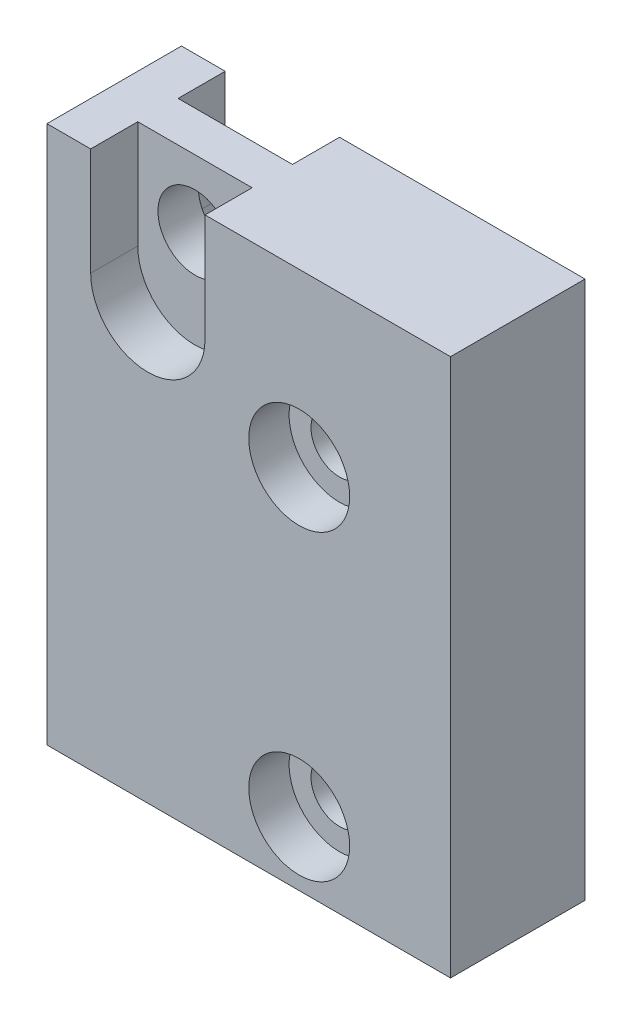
from build123d import *

# Parameters (mm, degrees)
EXTRUSION1_DEPTH      = 10
EXTRUSION1_DEPTH_BACK = 10
SKETCH1_W             = 60
SKETCH1_H             = 80
SKETCH1_R             = 5.5
SKETCH1_R_2           = 4.25
EXTRUSION2_START      = -6
SKETCH2_R             = 7.5
SKETCH2_R_2           = 4.25
EXTRUSION2_DEPTH      = 6
EXTRUSION3_START      = -7
SKETCH3_R             = 5.5
EXTRUSION3_DEPTH      = 7


with BuildPart() as part:
    # Sketch1 → Extrusion1 (new, two sides: drawn at the far end of the back side and taken through both)
    with BuildSketch(Plane.XY.offset(-EXTRUSION1_DEPTH_BACK)):
        Rectangle(SKETCH1_W, SKETCH1_H)
        with Locations((-15, 30)):
            Circle(SKETCH1_R, mode=Mode.SUBTRACT)
        with Locations((7.5, 14.5)):
            Circle(SKETCH1_R_2, mode=Mode.SUBTRACT)
        with Locations((7.5, -30.5)):
            Circle(SKETCH1_R_2, mode=Mode.SUBTRACT)
    extrude(amount=EXTRUSION1_DEPTH + EXTRUSION1_DEPTH_BACK)

    # Sketch2 → Extrusion2 (cut)
    # profile 1 of 2: a face of its own
    with BuildSketch(Plane.XY.offset(10).offset(EXTRUSION2_START)):
        with Locations((7.5, -30.5)):
            Circle(SKETCH2_R)
        with Locations((7.5, -30.5)):
            Circle(SKETCH2_R_2, mode=Mode.SUBTRACT)
    # profile 2 of 2: a face of its own
    with BuildSketch(Plane.XY.offset(10).offset(EXTRUSION2_START)):
        with Locations((7.5, 14.5)):
            Circle(SKETCH2_R)
        with Locations((7.5, 14.5)):
            Circle(SKETCH2_R_2, mode=Mode.SUBTRACT)
    extrusion2 = extrude(amount=EXTRUSION2_DEPTH, mode=Mode.SUBTRACT)

    # Sketch3 → Extrusion3 (cut)
    with BuildSketch(Plane.XY.offset(10).offset(EXTRUSION3_START)):
        with BuildLine():
            ThreePointArc((-23.5, 24), (-15, 15.5), (-6.5, 24))
            Line((-6.5, 24), (-6.5, 40))
            Line((-6.5, 40), (-23.5, 40))
            Line((-23.5, 40), (-23.5, 24))
        make_face()
        with Locations((-15, 30)):
            Circle(SKETCH3_R, mode=Mode.SUBTRACT)
    extrusion3 = extrude(amount=EXTRUSION3_DEPTH, mode=Mode.SUBTRACT)

    # Mirror1: Extrusion2, Extrusion3 across plane
    add(extrusion2.mirror(Plane.XY), mode=Mode.SUBTRACT)
    add(extrusion3.mirror(Plane.XY), mode=Mode.SUBTRACT)


solid = part.part
